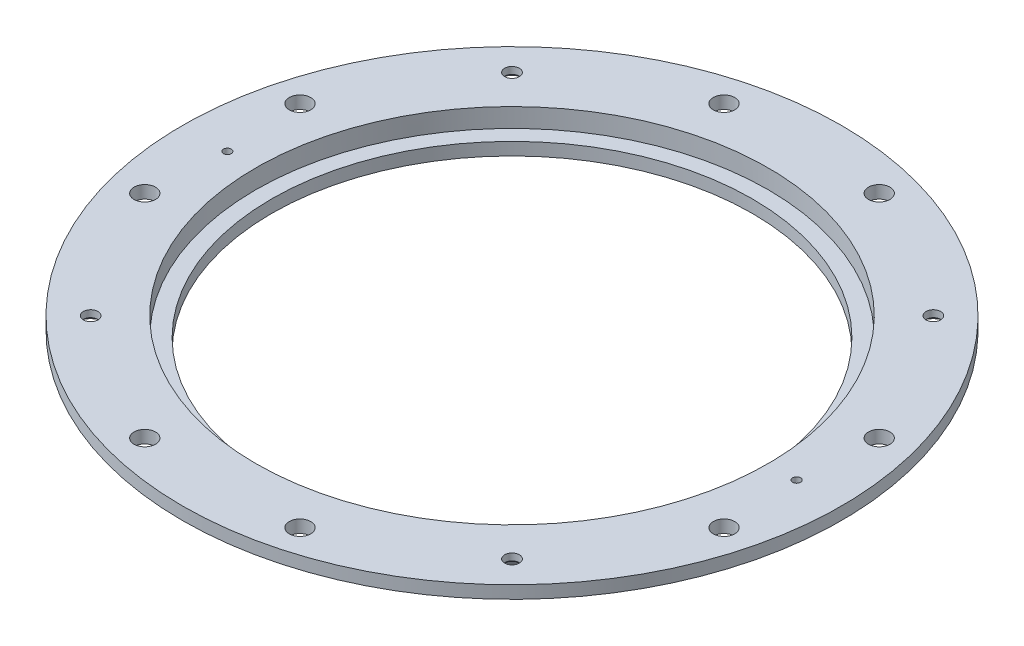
ISO-10303-21;
HEADER;
FILE_DESCRIPTION(('STEP AP214'),'2;1');
FILE_NAME('part.step','',(''),(''),'','','');
FILE_SCHEMA(('AUTOMOTIVE_DESIGN { 1 0 10303 214 1 1 1 1 }'));
ENDSEC;
DATA;
#1=APPLICATION_CONTEXT('core data for automotive mechanical design processes');
#2=APPLICATION_PROTOCOL_DEFINITION('international standard','automotive_design',2000,#1);
#3=PRODUCT_CONTEXT('',#1,'mechanical');
#4=PRODUCT('Part','Part','',(#3));
#5=PRODUCT_RELATED_PRODUCT_CATEGORY('part','',(#4));
#6=PRODUCT_DEFINITION_FORMATION('','',#4);
#7=PRODUCT_DEFINITION_CONTEXT('part definition',#1,'design');
#8=PRODUCT_DEFINITION('design','',#6,#7);
#9=PRODUCT_DEFINITION_SHAPE('','',#8);
#10=(LENGTH_UNIT() NAMED_UNIT(*) SI_UNIT(.MILLI.,.METRE.));
#11=(NAMED_UNIT(*) PLANE_ANGLE_UNIT() SI_UNIT($,.RADIAN.));
#12=(NAMED_UNIT(*) SI_UNIT($,.STERADIAN.) SOLID_ANGLE_UNIT());
#13=UNCERTAINTY_MEASURE_WITH_UNIT(LENGTH_MEASURE(1.E-05),#10,'distance_accuracy_value','');
#14=(GEOMETRIC_REPRESENTATION_CONTEXT(3) GLOBAL_UNCERTAINTY_ASSIGNED_CONTEXT((#13)) GLOBAL_UNIT_ASSIGNED_CONTEXT((#10,
#11,#12)) REPRESENTATION_CONTEXT('',''));
#15=CARTESIAN_POINT('',(0.,0.,0.));
#16=DIRECTION('',(0.,0.,1.));
#17=DIRECTION('',(1.,0.,0.));
#18=AXIS2_PLACEMENT_3D('',#15,#16,#17);
#19=CARTESIAN_POINT('',(0.,2.54,0.));
#20=DIRECTION('',(0.,-1.,0.));
#21=DIRECTION('',(0.,0.,-1.));
#22=AXIS2_PLACEMENT_3D('',#19,#20,#21);
#23=CYLINDRICAL_SURFACE('',#22,66.167);
#24=CARTESIAN_POINT('',(0.,2.54,0.));
#25=DIRECTION('',(0.,1.,0.));
#26=DIRECTION('',(0.,0.,1.));
#27=AXIS2_PLACEMENT_3D('',#24,#25,#26);
#28=CIRCLE('',#27,66.167);
#29=CARTESIAN_POINT('',(0.,2.54,66.167));
#30=VERTEX_POINT('',#29);
#31=EDGE_CURVE('E43',#30,#30,#28,.T.);
#32=ORIENTED_EDGE('',*,*,#31,.F.);
#33=EDGE_LOOP('',(#32));
#34=FACE_BOUND('',#33,.T.);
#35=CARTESIAN_POINT('',(0.,0.,0.));
#36=DIRECTION('',(0.,1.,0.));
#37=DIRECTION('',(0.,0.,1.));
#38=AXIS2_PLACEMENT_3D('',#35,#36,#37);
#39=CIRCLE('',#38,66.167);
#40=CARTESIAN_POINT('',(0.,0.,66.167));
#41=VERTEX_POINT('',#40);
#42=EDGE_CURVE('E48',#41,#41,#39,.T.);
#43=ORIENTED_EDGE('',*,*,#42,.T.);
#44=EDGE_LOOP('',(#43));
#45=FACE_BOUND('',#44,.T.);
#46=ADVANCED_FACE('F36',(#34,#45),#23,.T.);
#47=CARTESIAN_POINT('',(0.,2.54,0.));
#48=DIRECTION('',(0.,1.,0.));
#49=DIRECTION('',(0.,0.,1.));
#50=AXIS2_PLACEMENT_3D('',#47,#48,#49);
#51=PLANE('',#50);
#52=CARTESIAN_POINT('',(0.,2.54,0.));
#53=DIRECTION('',(0.,1.,0.));
#54=DIRECTION('',(0.,0.,1.));
#55=AXIS2_PLACEMENT_3D('',#52,#53,#54);
#56=CIRCLE('',#55,51.435);
#57=CARTESIAN_POINT('',(0.,2.54,51.435));
#58=VERTEX_POINT('',#57);
#59=EDGE_CURVE('E170',#58,#58,#56,.T.);
#60=ORIENTED_EDGE('',*,*,#59,.F.);
#61=EDGE_LOOP('',(#60));
#62=FACE_BOUND('',#61,.T.);
#63=CARTESIAN_POINT('',(-58.1468028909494,2.54,15.5803888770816));
#64=DIRECTION('',(0.,1.,0.));
#65=DIRECTION('',(0.,0.,1.));
#66=AXIS2_PLACEMENT_3D('',#63,#64,#65);
#67=CIRCLE('',#66,2.15265);
#68=CARTESIAN_POINT('',(-58.1468028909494,2.54,17.7330388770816));
#69=VERTEX_POINT('',#68);
#70=EDGE_CURVE('E174',#69,#69,#67,.T.);
#71=ORIENTED_EDGE('',*,*,#70,.F.);
#72=EDGE_LOOP('',(#71));
#73=FACE_BOUND('',#72,.T.);
#74=CARTESIAN_POINT('',(-58.1468028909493,2.54,-15.5803888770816));
#75=DIRECTION('',(0.,1.,0.));
#76=DIRECTION('',(0.,0.,1.));
#77=AXIS2_PLACEMENT_3D('',#74,#75,#76);
#78=CIRCLE('',#77,2.15265);
#79=CARTESIAN_POINT('',(-58.1468028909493,2.54,-13.4277388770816));
#80=VERTEX_POINT('',#79);
#81=EDGE_CURVE('E178',#80,#80,#78,.T.);
#82=ORIENTED_EDGE('',*,*,#81,.F.);
#83=EDGE_LOOP('',(#82));
#84=FACE_BOUND('',#83,.T.);
#85=CARTESIAN_POINT('',(-15.5803953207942,2.54,-58.1468184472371));
#86=DIRECTION('',(0.,1.,0.));
#87=DIRECTION('',(0.,0.,1.));
#88=AXIS2_PLACEMENT_3D('',#85,#86,#87);
#89=CIRCLE('',#88,2.15265);
#90=CARTESIAN_POINT('',(-15.5803953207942,2.54,-55.9941684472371));
#91=VERTEX_POINT('',#90);
#92=EDGE_CURVE('E182',#91,#91,#89,.T.);
#93=ORIENTED_EDGE('',*,*,#92,.F.);
#94=EDGE_LOOP('',(#93));
#95=FACE_BOUND('',#94,.T.);
#96=CARTESIAN_POINT('',(15.5803824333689,2.54,-58.1468184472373));
#97=DIRECTION('',(0.,1.,0.));
#98=DIRECTION('',(0.,0.,1.));
#99=AXIS2_PLACEMENT_3D('',#96,#97,#98);
#100=CIRCLE('',#99,2.15265);
#101=CARTESIAN_POINT('',(15.5803824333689,2.54,-55.9941684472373));
#102=VERTEX_POINT('',#101);
#103=EDGE_CURVE('E72',#102,#102,#100,.T.);
#104=ORIENTED_EDGE('',*,*,#103,.F.);
#105=EDGE_LOOP('',(#104));
#106=FACE_BOUND('',#105,.T.);
#107=CARTESIAN_POINT('',(58.1468028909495,2.54,-15.5803888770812));
#108=DIRECTION('',(0.,1.,0.));
#109=DIRECTION('',(0.,0.,1.));
#110=AXIS2_PLACEMENT_3D('',#107,#108,#109);
#111=CIRCLE('',#110,2.15265);
#112=CARTESIAN_POINT('',(58.1468028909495,2.54,-13.4277388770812));
#113=VERTEX_POINT('',#112);
#114=EDGE_CURVE('E62',#113,#113,#111,.T.);
#115=ORIENTED_EDGE('',*,*,#114,.F.);
#116=EDGE_LOOP('',(#115));
#117=FACE_BOUND('',#116,.T.);
#118=CARTESIAN_POINT('',(58.1468028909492,2.54,15.580388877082));
#119=DIRECTION('',(0.,1.,0.));
#120=DIRECTION('',(0.,0.,1.));
#121=AXIS2_PLACEMENT_3D('',#118,#119,#120);
#122=CIRCLE('',#121,2.15265);
#123=CARTESIAN_POINT('',(58.1468028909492,2.54,17.733038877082));
#124=VERTEX_POINT('',#123);
#125=EDGE_CURVE('E59',#124,#124,#122,.T.);
#126=ORIENTED_EDGE('',*,*,#125,.F.);
#127=EDGE_LOOP('',(#126));
#128=FACE_BOUND('',#127,.T.);
#129=CARTESIAN_POINT('',(15.580388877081,2.54,58.1468028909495));
#130=DIRECTION('',(0.,1.,0.));
#131=DIRECTION('',(0.,0.,1.));
#132=AXIS2_PLACEMENT_3D('',#129,#130,#131);
#133=CIRCLE('',#132,2.15265);
#134=CARTESIAN_POINT('',(15.580388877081,2.54,60.2994528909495));
#135=VERTEX_POINT('',#134);
#136=EDGE_CURVE('E58',#135,#135,#133,.T.);
#137=ORIENTED_EDGE('',*,*,#136,.F.);
#138=EDGE_LOOP('',(#137));
#139=FACE_BOUND('',#138,.T.);
#140=CARTESIAN_POINT('',(-15.5803888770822,2.54,58.1468028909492));
#141=DIRECTION('',(0.,1.,0.));
#142=DIRECTION('',(0.,0.,1.));
#143=AXIS2_PLACEMENT_3D('',#140,#141,#142);
#144=CIRCLE('',#143,2.15265);
#145=CARTESIAN_POINT('',(-15.5803888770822,2.54,60.2994528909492));
#146=VERTEX_POINT('',#145);
#147=EDGE_CURVE('E81',#146,#146,#144,.T.);
#148=ORIENTED_EDGE('',*,*,#147,.F.);
#149=EDGE_LOOP('',(#148));
#150=FACE_BOUND('',#149,.T.);
#151=CARTESIAN_POINT('',(-42.2970063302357,2.54,42.2970063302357));
#152=DIRECTION('',(0.,-1.,0.));
#153=DIRECTION('',(0.,0.,-1.));
#154=AXIS2_PLACEMENT_3D('',#151,#152,#153);
#155=CIRCLE('',#154,1.4732);
#156=CARTESIAN_POINT('',(-42.2970063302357,2.54,40.8238063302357));
#157=VERTEX_POINT('',#156);
#158=EDGE_CURVE('E93',#157,#157,#155,.T.);
#159=ORIENTED_EDGE('',*,*,#158,.T.);
#160=EDGE_LOOP('',(#159));
#161=FACE_BOUND('',#160,.T.);
#162=CARTESIAN_POINT('',(42.2970063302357,2.54,42.2970063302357));
#163=DIRECTION('',(0.,-1.,0.));
#164=DIRECTION('',(0.,0.,-1.));
#165=AXIS2_PLACEMENT_3D('',#162,#163,#164);
#166=CIRCLE('',#165,1.4732);
#167=CARTESIAN_POINT('',(42.2970063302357,2.54,40.8238063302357));
#168=VERTEX_POINT('',#167);
#169=EDGE_CURVE('E102',#168,#168,#166,.T.);
#170=ORIENTED_EDGE('',*,*,#169,.T.);
#171=EDGE_LOOP('',(#170));
#172=FACE_BOUND('',#171,.T.);
#173=CARTESIAN_POINT('',(42.2970063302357,2.54,-42.2970063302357));
#174=DIRECTION('',(0.,-1.,0.));
#175=DIRECTION('',(0.,0.,-1.));
#176=AXIS2_PLACEMENT_3D('',#173,#174,#175);
#177=CIRCLE('',#176,1.4732);
#178=CARTESIAN_POINT('',(42.2970063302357,2.54,-43.7702063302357));
#179=VERTEX_POINT('',#178);
#180=EDGE_CURVE('E111',#179,#179,#177,.T.);
#181=ORIENTED_EDGE('',*,*,#180,.T.);
#182=EDGE_LOOP('',(#181));
#183=FACE_BOUND('',#182,.T.);
#184=CARTESIAN_POINT('',(-42.2970063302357,2.54,-42.2970063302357));
#185=DIRECTION('',(0.,-1.,0.));
#186=DIRECTION('',(0.,0.,-1.));
#187=AXIS2_PLACEMENT_3D('',#184,#185,#186);
#188=CIRCLE('',#187,1.4732);
#189=CARTESIAN_POINT('',(-42.2970063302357,2.54,-43.7702063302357));
#190=VERTEX_POINT('',#189);
#191=EDGE_CURVE('E120',#190,#190,#188,.T.);
#192=ORIENTED_EDGE('',*,*,#191,.T.);
#193=EDGE_LOOP('',(#192));
#194=FACE_BOUND('',#193,.T.);
#195=CARTESIAN_POINT('',(57.15,2.54,0.));
#196=DIRECTION('',(0.,1.,0.));
#197=DIRECTION('',(0.,0.,1.));
#198=AXIS2_PLACEMENT_3D('',#195,#196,#197);
#199=CIRCLE('',#198,0.793749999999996);
#200=CARTESIAN_POINT('',(57.15,2.54,0.793749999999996));
#201=VERTEX_POINT('',#200);
#202=EDGE_CURVE('E123',#201,#201,#199,.T.);
#203=ORIENTED_EDGE('',*,*,#202,.F.);
#204=EDGE_LOOP('',(#203));
#205=FACE_BOUND('',#204,.T.);
#206=CARTESIAN_POINT('',(-57.15,2.54,0.));
#207=DIRECTION('',(0.,1.,0.));
#208=DIRECTION('',(0.,0.,1.));
#209=AXIS2_PLACEMENT_3D('',#206,#207,#208);
#210=CIRCLE('',#209,0.793749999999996);
#211=CARTESIAN_POINT('',(-57.15,2.54,0.793749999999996));
#212=VERTEX_POINT('',#211);
#213=EDGE_CURVE('E129',#212,#212,#210,.T.);
#214=ORIENTED_EDGE('',*,*,#213,.F.);
#215=EDGE_LOOP('',(#214));
#216=FACE_BOUND('',#215,.T.);
#217=ORIENTED_EDGE('',*,*,#31,.T.);
#218=EDGE_LOOP('',(#217));
#219=FACE_BOUND('',#218,.T.);
#220=ADVANCED_FACE('F151',(#62,#73,#84,#95,#106,#117,#128,#139,#150,#161,#172,#183,#194,#205,
#216,#219),#51,.T.);
#221=CARTESIAN_POINT('',(0.,0.,0.));
#222=DIRECTION('',(0.,1.,0.));
#223=DIRECTION('',(0.,0.,1.));
#224=AXIS2_PLACEMENT_3D('',#221,#222,#223);
#225=PLANE('',#224);
#226=CARTESIAN_POINT('',(-58.1468028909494,0.,15.5803888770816));
#227=DIRECTION('',(0.,1.,0.));
#228=DIRECTION('',(0.,0.,1.));
#229=AXIS2_PLACEMENT_3D('',#226,#227,#228);
#230=CIRCLE('',#229,2.15265);
#231=CARTESIAN_POINT('',(-58.1468028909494,0.,17.7330388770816));
#232=VERTEX_POINT('',#231);
#233=EDGE_CURVE('E306',#232,#232,#230,.T.);
#234=ORIENTED_EDGE('',*,*,#233,.T.);
#235=EDGE_LOOP('',(#234));
#236=FACE_BOUND('',#235,.T.);
#237=CARTESIAN_POINT('',(-58.1468028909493,0.,-15.5803888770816));
#238=DIRECTION('',(0.,1.,0.));
#239=DIRECTION('',(0.,0.,1.));
#240=AXIS2_PLACEMENT_3D('',#237,#238,#239);
#241=CIRCLE('',#240,2.15265);
#242=CARTESIAN_POINT('',(-58.1468028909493,0.,-13.4277388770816));
#243=VERTEX_POINT('',#242);
#244=EDGE_CURVE('E310',#243,#243,#241,.T.);
#245=ORIENTED_EDGE('',*,*,#244,.T.);
#246=EDGE_LOOP('',(#245));
#247=FACE_BOUND('',#246,.T.);
#248=CARTESIAN_POINT('',(-15.5803953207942,0.,-58.1468184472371));
#249=DIRECTION('',(0.,1.,0.));
#250=DIRECTION('',(0.,0.,1.));
#251=AXIS2_PLACEMENT_3D('',#248,#249,#250);
#252=CIRCLE('',#251,2.15265);
#253=CARTESIAN_POINT('',(-15.5803953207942,0.,-55.9941684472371));
#254=VERTEX_POINT('',#253);
#255=EDGE_CURVE('E313',#254,#254,#252,.T.);
#256=ORIENTED_EDGE('',*,*,#255,.T.);
#257=EDGE_LOOP('',(#256));
#258=FACE_BOUND('',#257,.T.);
#259=CARTESIAN_POINT('',(15.5803824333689,0.,-58.1468184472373));
#260=DIRECTION('',(0.,1.,0.));
#261=DIRECTION('',(0.,0.,1.));
#262=AXIS2_PLACEMENT_3D('',#259,#260,#261);
#263=CIRCLE('',#262,2.15265);
#264=CARTESIAN_POINT('',(15.5803824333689,0.,-55.9941684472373));
#265=VERTEX_POINT('',#264);
#266=EDGE_CURVE('E39',#265,#265,#263,.T.);
#267=ORIENTED_EDGE('',*,*,#266,.T.);
#268=EDGE_LOOP('',(#267));
#269=FACE_BOUND('',#268,.T.);
#270=CARTESIAN_POINT('',(58.1468028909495,0.,-15.5803888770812));
#271=DIRECTION('',(0.,1.,0.));
#272=DIRECTION('',(0.,0.,1.));
#273=AXIS2_PLACEMENT_3D('',#270,#271,#272);
#274=CIRCLE('',#273,2.15265);
#275=CARTESIAN_POINT('',(58.1468028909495,0.,-13.4277388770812));
#276=VERTEX_POINT('',#275);
#277=EDGE_CURVE('E60',#276,#276,#274,.T.);
#278=ORIENTED_EDGE('',*,*,#277,.T.);
#279=EDGE_LOOP('',(#278));
#280=FACE_BOUND('',#279,.T.);
#281=CARTESIAN_POINT('',(58.1468028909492,0.,15.580388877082));
#282=DIRECTION('',(0.,1.,0.));
#283=DIRECTION('',(0.,0.,1.));
#284=AXIS2_PLACEMENT_3D('',#281,#282,#283);
#285=CIRCLE('',#284,2.15265);
#286=CARTESIAN_POINT('',(58.1468028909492,0.,17.733038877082));
#287=VERTEX_POINT('',#286);
#288=EDGE_CURVE('E56',#287,#287,#285,.T.);
#289=ORIENTED_EDGE('',*,*,#288,.T.);
#290=EDGE_LOOP('',(#289));
#291=FACE_BOUND('',#290,.T.);
#292=CARTESIAN_POINT('',(15.580388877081,0.,58.1468028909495));
#293=DIRECTION('',(0.,1.,0.));
#294=DIRECTION('',(0.,0.,1.));
#295=AXIS2_PLACEMENT_3D('',#292,#293,#294);
#296=CIRCLE('',#295,2.15265);
#297=CARTESIAN_POINT('',(15.580388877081,0.,60.2994528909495));
#298=VERTEX_POINT('',#297);
#299=EDGE_CURVE('E78',#298,#298,#296,.T.);
#300=ORIENTED_EDGE('',*,*,#299,.T.);
#301=EDGE_LOOP('',(#300));
#302=FACE_BOUND('',#301,.T.);
#303=CARTESIAN_POINT('',(-15.5803888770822,0.,58.1468028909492));
#304=DIRECTION('',(0.,1.,0.));
#305=DIRECTION('',(0.,0.,1.));
#306=AXIS2_PLACEMENT_3D('',#303,#304,#305);
#307=CIRCLE('',#306,2.15265);
#308=CARTESIAN_POINT('',(-15.5803888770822,0.,60.2994528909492));
#309=VERTEX_POINT('',#308);
#310=EDGE_CURVE('E84',#309,#309,#307,.T.);
#311=ORIENTED_EDGE('',*,*,#310,.T.);
#312=EDGE_LOOP('',(#311));
#313=FACE_BOUND('',#312,.T.);
#314=CARTESIAN_POINT('',(-42.2970063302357,0.,42.2970063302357));
#315=DIRECTION('',(0.,-1.,0.));
#316=DIRECTION('',(0.,0.,-1.));
#317=AXIS2_PLACEMENT_3D('',#314,#315,#316);
#318=CIRCLE('',#317,2.8575);
#319=CARTESIAN_POINT('',(-42.2970063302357,0.,39.4395063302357));
#320=VERTEX_POINT('',#319);
#321=EDGE_CURVE('E87',#320,#320,#318,.T.);
#322=ORIENTED_EDGE('',*,*,#321,.F.);
#323=EDGE_LOOP('',(#322));
#324=FACE_BOUND('',#323,.T.);
#325=CARTESIAN_POINT('',(42.2970063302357,0.,42.2970063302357));
#326=DIRECTION('',(0.,-1.,0.));
#327=DIRECTION('',(0.,0.,-1.));
#328=AXIS2_PLACEMENT_3D('',#325,#326,#327);
#329=CIRCLE('',#328,2.8575);
#330=CARTESIAN_POINT('',(42.2970063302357,0.,39.4395063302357));
#331=VERTEX_POINT('',#330);
#332=EDGE_CURVE('E96',#331,#331,#329,.T.);
#333=ORIENTED_EDGE('',*,*,#332,.F.);
#334=EDGE_LOOP('',(#333));
#335=FACE_BOUND('',#334,.T.);
#336=CARTESIAN_POINT('',(42.2970063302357,0.,-42.2970063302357));
#337=DIRECTION('',(0.,-1.,0.));
#338=DIRECTION('',(0.,0.,-1.));
#339=AXIS2_PLACEMENT_3D('',#336,#337,#338);
#340=CIRCLE('',#339,2.8575);
#341=CARTESIAN_POINT('',(42.2970063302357,0.,-45.1545063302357));
#342=VERTEX_POINT('',#341);
#343=EDGE_CURVE('E105',#342,#342,#340,.T.);
#344=ORIENTED_EDGE('',*,*,#343,.F.);
#345=EDGE_LOOP('',(#344));
#346=FACE_BOUND('',#345,.T.);
#347=CARTESIAN_POINT('',(-42.2970063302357,0.,-42.2970063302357));
#348=DIRECTION('',(0.,-1.,0.));
#349=DIRECTION('',(0.,0.,-1.));
#350=AXIS2_PLACEMENT_3D('',#347,#348,#349);
#351=CIRCLE('',#350,2.8575);
#352=CARTESIAN_POINT('',(-42.2970063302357,0.,-45.1545063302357));
#353=VERTEX_POINT('',#352);
#354=EDGE_CURVE('E114',#353,#353,#351,.T.);
#355=ORIENTED_EDGE('',*,*,#354,.F.);
#356=EDGE_LOOP('',(#355));
#357=FACE_BOUND('',#356,.T.);
#358=CARTESIAN_POINT('',(57.15,0.,0.));
#359=DIRECTION('',(0.,1.,0.));
#360=DIRECTION('',(0.,0.,1.));
#361=AXIS2_PLACEMENT_3D('',#358,#359,#360);
#362=CIRCLE('',#361,0.793749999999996);
#363=CARTESIAN_POINT('',(57.15,0.,0.793749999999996));
#364=VERTEX_POINT('',#363);
#365=EDGE_CURVE('E126',#364,#364,#362,.T.);
#366=ORIENTED_EDGE('',*,*,#365,.T.);
#367=EDGE_LOOP('',(#366));
#368=FACE_BOUND('',#367,.T.);
#369=CARTESIAN_POINT('',(-57.15,0.,0.));
#370=DIRECTION('',(0.,1.,0.));
#371=DIRECTION('',(0.,0.,1.));
#372=AXIS2_PLACEMENT_3D('',#369,#370,#371);
#373=CIRCLE('',#372,0.793749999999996);
#374=CARTESIAN_POINT('',(-57.15,0.,0.793749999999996));
#375=VERTEX_POINT('',#374);
#376=EDGE_CURVE('E131',#375,#375,#373,.T.);
#377=ORIENTED_EDGE('',*,*,#376,.T.);
#378=EDGE_LOOP('',(#377));
#379=FACE_BOUND('',#378,.T.);
#380=CARTESIAN_POINT('',(0.,0.,0.));
#381=DIRECTION('',(0.,-1.,0.));
#382=DIRECTION('',(0.,0.,-1.));
#383=AXIS2_PLACEMENT_3D('',#380,#381,#382);
#384=CIRCLE('',#383,52.07);
#385=CARTESIAN_POINT('',(0.,0.,52.07));
#386=VERTEX_POINT('',#385);
#387=EDGE_CURVE('E11',#386,#386,#384,.T.);
#388=ORIENTED_EDGE('',*,*,#387,.F.);
#389=EDGE_LOOP('',(#388));
#390=FACE_BOUND('',#389,.T.);
#391=ORIENTED_EDGE('',*,*,#42,.F.);
#392=EDGE_LOOP('',(#391));
#393=FACE_BOUND('',#392,.T.);
#394=ADVANCED_FACE('F142',(#236,#247,#258,#269,#280,#291,#302,#313,#324,#335,#346,#357,#368,
#379,#390,#393),#225,.F.);
#395=CARTESIAN_POINT('',(0.,-3.81,0.));
#396=DIRECTION('',(0.,1.,0.));
#397=DIRECTION('',(0.,0.,1.));
#398=AXIS2_PLACEMENT_3D('',#395,#396,#397);
#399=CYLINDRICAL_SURFACE('',#398,52.07);
#400=CARTESIAN_POINT('',(0.,-3.81,0.));
#401=DIRECTION('',(0.,-1.,0.));
#402=DIRECTION('',(0.,0.,-1.));
#403=AXIS2_PLACEMENT_3D('',#400,#401,#402);
#404=CIRCLE('',#403,52.07);
#405=CARTESIAN_POINT('',(0.,-3.81,52.07));
#406=VERTEX_POINT('',#405);
#407=EDGE_CURVE('E51',#406,#406,#404,.T.);
#408=CARTESIAN_POINT('',(0.,-3.81,52.07));
#409=CARTESIAN_POINT('',(0.,-3.7703125,52.07));
#410=CARTESIAN_POINT('',(0.,-3.730625,52.07));
#411=CARTESIAN_POINT('',(0.,-3.65125,52.07));
#412=CARTESIAN_POINT('',(0.,-3.6115625,52.07));
#413=CARTESIAN_POINT('',(0.,-3.5321875,52.07));
#414=CARTESIAN_POINT('',(0.,-3.4925,52.07));
#415=CARTESIAN_POINT('',(0.,-3.413125,52.07));
#416=CARTESIAN_POINT('',(0.,-3.3734375,52.07));
#417=CARTESIAN_POINT('',(0.,-3.2940625,52.07));
#418=CARTESIAN_POINT('',(0.,-3.254375,52.07));
#419=CARTESIAN_POINT('',(0.,-3.175,52.07));
#420=CARTESIAN_POINT('',(0.,-3.1353125,52.07));
#421=CARTESIAN_POINT('',(0.,-3.0559375,52.07));
#422=CARTESIAN_POINT('',(0.,-3.01625,52.07));
#423=CARTESIAN_POINT('',(0.,-2.936875,52.07));
#424=CARTESIAN_POINT('',(0.,-2.8971875,52.07));
#425=CARTESIAN_POINT('',(0.,-2.8178125,52.07));
#426=CARTESIAN_POINT('',(0.,-2.778125,52.07));
#427=CARTESIAN_POINT('',(0.,-2.69875,52.07));
#428=CARTESIAN_POINT('',(0.,-2.6590625,52.07));
#429=CARTESIAN_POINT('',(0.,-2.5796875,52.07));
#430=CARTESIAN_POINT('',(0.,-2.54,52.07));
#431=CARTESIAN_POINT('',(0.,-2.460625,52.07));
#432=CARTESIAN_POINT('',(0.,-2.4209375,52.07));
#433=CARTESIAN_POINT('',(0.,-2.3415625,52.07));
#434=CARTESIAN_POINT('',(0.,-2.301875,52.07));
#435=CARTESIAN_POINT('',(0.,-2.2225,52.07));
#436=CARTESIAN_POINT('',(0.,-2.1828125,52.07));
#437=CARTESIAN_POINT('',(0.,-2.1034375,52.07));
#438=CARTESIAN_POINT('',(0.,-2.06375,52.07));
#439=CARTESIAN_POINT('',(0.,-1.984375,52.07));
#440=CARTESIAN_POINT('',(0.,-1.9446875,52.07));
#441=CARTESIAN_POINT('',(0.,-1.8653125,52.07));
#442=CARTESIAN_POINT('',(0.,-1.825625,52.07));
#443=CARTESIAN_POINT('',(0.,-1.74625,52.07));
#444=CARTESIAN_POINT('',(0.,-1.7065625,52.07));
#445=CARTESIAN_POINT('',(0.,-1.6271875,52.07));
#446=CARTESIAN_POINT('',(0.,-1.5875,52.07));
#447=CARTESIAN_POINT('',(0.,-1.508125,52.07));
#448=CARTESIAN_POINT('',(0.,-1.4684375,52.07));
#449=CARTESIAN_POINT('',(0.,-1.3890625,52.07));
#450=CARTESIAN_POINT('',(0.,-1.349375,52.07));
#451=CARTESIAN_POINT('',(0.,-1.27,52.07));
#452=CARTESIAN_POINT('',(0.,-1.2303125,52.07));
#453=CARTESIAN_POINT('',(0.,-1.1509375,52.07));
#454=CARTESIAN_POINT('',(0.,-1.11125,52.07));
#455=CARTESIAN_POINT('',(0.,-1.031875,52.07));
#456=CARTESIAN_POINT('',(0.,-0.9921875,52.07));
#457=CARTESIAN_POINT('',(0.,-0.9128125,52.07));
#458=CARTESIAN_POINT('',(0.,-0.873125,52.07));
#459=CARTESIAN_POINT('',(0.,-0.79375,52.07));
#460=CARTESIAN_POINT('',(0.,-0.7540625,52.07));
#461=CARTESIAN_POINT('',(0.,-0.6746875,52.07));
#462=CARTESIAN_POINT('',(0.,-0.635,52.07));
#463=CARTESIAN_POINT('',(0.,-0.555625,52.07));
#464=CARTESIAN_POINT('',(0.,-0.5159375,52.07));
#465=CARTESIAN_POINT('',(0.,-0.4365625,52.07));
#466=CARTESIAN_POINT('',(0.,-0.396875,52.07));
#467=CARTESIAN_POINT('',(0.,-0.3175,52.07));
#468=CARTESIAN_POINT('',(0.,-0.2778125,52.07));
#469=CARTESIAN_POINT('',(0.,-0.1984375,52.07));
#470=CARTESIAN_POINT('',(0.,-0.15875,52.07));
#471=CARTESIAN_POINT('',(0.,-0.0793749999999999,52.07));
#472=CARTESIAN_POINT('',(0.,-0.0396874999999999,52.07));
#473=CARTESIAN_POINT('',(0.,0.,52.07));
#474=B_SPLINE_CURVE_WITH_KNOTS('',3,(#408,#409,#410,#411,#412,#413,#414,#415,#416,#417,#418,
#419,#420,#421,#422,#423,#424,#425,#426,#427,#428,#429,#430,#431,#432,#433,#434,#435,#436,#437,
#438,#439,#440,#441,#442,#443,#444,#445,#446,#447,#448,#449,#450,#451,#452,#453,#454,#455,#456,
#457,#458,#459,#460,#461,#462,#463,#464,#465,#466,#467,#468,#469,#470,#471,#472,#473),
.UNSPECIFIED.,.F.,.F.,(4,2,2,2,2,2,2,2,2,2,2,2,2,2,2,2,2,2,2,2,2,2,2,2,2,2,2,2,2,2,2,2,4),(0.,
0.1190625,0.238125,0.3571875,0.47625,0.595312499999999,0.714375,0.833437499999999,
0.952499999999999,1.0715625,1.190625,1.3096875,1.42875,1.5478125,1.666875,1.7859375,1.905,
2.0240625,2.143125,2.2621875,2.38125,2.5003125,2.619375,2.7384375,2.8575,2.9765625,3.095625,
3.2146875,3.33375,3.4528125,3.571875,3.6909375,3.81),.UNSPECIFIED.);
#475=EDGE_CURVE('BSEAM140',#406,#386,#474,.T.);
#476=ORIENTED_EDGE('',*,*,#407,.F.);
#477=ORIENTED_EDGE('',*,*,#387,.T.);
#478=ORIENTED_EDGE('',*,*,#475,.T.);
#479=ORIENTED_EDGE('',*,*,#475,.F.);
#480=EDGE_LOOP('',(#476,#478,#477,#479));
#481=FACE_BOUND('',#480,.T.);
#482=ADVANCED_FACE('F140',(#481),#399,.T.);
#483=CARTESIAN_POINT('',(0.,-3.81,0.));
#484=DIRECTION('',(0.,-1.,0.));
#485=DIRECTION('',(0.,0.,-1.));
#486=AXIS2_PLACEMENT_3D('',#483,#484,#485);
#487=PLANE('',#486);
#488=CARTESIAN_POINT('',(0.,-3.81,0.));
#489=DIRECTION('',(0.,1.,0.));
#490=DIRECTION('',(0.,0.,1.));
#491=AXIS2_PLACEMENT_3D('',#488,#489,#490);
#492=CIRCLE('',#491,48.26);
#493=CARTESIAN_POINT('',(0.,-3.81,48.26));
#494=VERTEX_POINT('',#493);
#495=EDGE_CURVE('E294',#494,#494,#492,.T.);
#496=ORIENTED_EDGE('',*,*,#495,.T.);
#497=EDGE_LOOP('',(#496));
#498=FACE_BOUND('',#497,.T.);
#499=ORIENTED_EDGE('',*,*,#407,.T.);
#500=EDGE_LOOP('',(#499));
#501=FACE_BOUND('',#500,.T.);
#502=ADVANCED_FACE('F138',(#498,#501),#487,.T.);
#503=CARTESIAN_POINT('',(0.,-1.27,0.));
#504=DIRECTION('',(0.,-1.,0.));
#505=DIRECTION('',(0.,0.,-1.));
#506=AXIS2_PLACEMENT_3D('',#503,#504,#505);
#507=PLANE('',#506);
#508=CARTESIAN_POINT('',(0.,-1.27,0.));
#509=DIRECTION('',(0.,1.,0.));
#510=DIRECTION('',(0.,0.,1.));
#511=AXIS2_PLACEMENT_3D('',#508,#509,#510);
#512=CIRCLE('',#511,48.26);
#513=CARTESIAN_POINT('',(0.,-1.27,48.26));
#514=VERTEX_POINT('',#513);
#515=EDGE_CURVE('E297',#514,#514,#512,.T.);
#516=ORIENTED_EDGE('',*,*,#515,.F.);
#517=EDGE_LOOP('',(#516));
#518=FACE_BOUND('',#517,.T.);
#519=CARTESIAN_POINT('',(0.,-1.26999999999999,0.));
#520=DIRECTION('',(0.,-1.,0.));
#521=DIRECTION('',(0.,0.,-1.));
#522=AXIS2_PLACEMENT_3D('',#519,#520,#521);
#523=CIRCLE('',#522,51.435);
#524=CARTESIAN_POINT('',(0.,-1.26999999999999,-51.435));
#525=VERTEX_POINT('',#524);
#526=EDGE_CURVE('E302',#525,#525,#523,.F.);
#527=ORIENTED_EDGE('',*,*,#526,.T.);
#528=EDGE_LOOP('',(#527));
#529=FACE_BOUND('',#528,.T.);
#530=ADVANCED_FACE('F148',(#518,#529),#507,.F.);
#531=CARTESIAN_POINT('',(-57.15,2.54,0.));
#532=DIRECTION('',(0.,1.,0.));
#533=DIRECTION('',(0.,0.,1.));
#534=AXIS2_PLACEMENT_3D('',#531,#532,#533);
#535=CYLINDRICAL_SURFACE('',#534,0.793749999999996);
#536=ORIENTED_EDGE('',*,*,#213,.T.);
#537=EDGE_LOOP('',(#536));
#538=FACE_BOUND('',#537,.T.);
#539=ORIENTED_EDGE('',*,*,#376,.F.);
#540=EDGE_LOOP('',(#539));
#541=FACE_BOUND('',#540,.T.);
#542=ADVANCED_FACE('F205',(#538,#541),#535,.F.);
#543=CARTESIAN_POINT('',(57.15,2.54,0.));
#544=DIRECTION('',(0.,1.,0.));
#545=DIRECTION('',(0.,0.,1.));
#546=AXIS2_PLACEMENT_3D('',#543,#544,#545);
#547=CYLINDRICAL_SURFACE('',#546,0.793749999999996);
#548=ORIENTED_EDGE('',*,*,#202,.T.);
#549=EDGE_LOOP('',(#548));
#550=FACE_BOUND('',#549,.T.);
#551=ORIENTED_EDGE('',*,*,#365,.F.);
#552=EDGE_LOOP('',(#551));
#553=FACE_BOUND('',#552,.T.);
#554=ADVANCED_FACE('F208',(#550,#553),#547,.F.);
#555=CARTESIAN_POINT('',(-42.2970063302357,0.,-42.2970063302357));
#556=DIRECTION('',(0.,-1.,0.));
#557=DIRECTION('',(0.,0.,-1.));
#558=AXIS2_PLACEMENT_3D('',#555,#556,#557);
#559=CYLINDRICAL_SURFACE('',#558,1.4732);
#560=ORIENTED_EDGE('',*,*,#191,.F.);
#561=EDGE_LOOP('',(#560));
#562=FACE_BOUND('',#561,.T.);
#563=CARTESIAN_POINT('',(-42.2970063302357,1.16156561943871,-42.2970063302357));
#564=DIRECTION('',(0.,-1.,0.));
#565=DIRECTION('',(0.,0.,-1.));
#566=AXIS2_PLACEMENT_3D('',#563,#564,#565);
#567=CIRCLE('',#566,1.4732);
#568=CARTESIAN_POINT('',(-42.2970063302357,1.16156561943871,-43.7702063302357));
#569=VERTEX_POINT('',#568);
#570=EDGE_CURVE('E117',#569,#569,#567,.T.);
#571=ORIENTED_EDGE('',*,*,#570,.T.);
#572=EDGE_LOOP('',(#571));
#573=FACE_BOUND('',#572,.T.);
#574=ADVANCED_FACE('F214',(#562,#573),#559,.F.);
#575=CARTESIAN_POINT('',(-42.2970063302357,0.,-42.2970063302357));
#576=DIRECTION('',(0.,-1.,0.));
#577=DIRECTION('',(0.,0.,-1.));
#578=AXIS2_PLACEMENT_3D('',#575,#576,#577);
#579=CONICAL_SURFACE('',#578,2.8575,0.872664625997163);
#580=ORIENTED_EDGE('',*,*,#570,.F.);
#581=EDGE_LOOP('',(#580));
#582=FACE_BOUND('',#581,.T.);
#583=ORIENTED_EDGE('',*,*,#354,.T.);
#584=EDGE_LOOP('',(#583));
#585=FACE_BOUND('',#584,.T.);
#586=ADVANCED_FACE('F222',(#582,#585),#579,.F.);
#587=CARTESIAN_POINT('',(42.2970063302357,0.,-42.2970063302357));
#588=DIRECTION('',(0.,-1.,0.));
#589=DIRECTION('',(0.,0.,-1.));
#590=AXIS2_PLACEMENT_3D('',#587,#588,#589);
#591=CYLINDRICAL_SURFACE('',#590,1.4732);
#592=ORIENTED_EDGE('',*,*,#180,.F.);
#593=EDGE_LOOP('',(#592));
#594=FACE_BOUND('',#593,.T.);
#595=CARTESIAN_POINT('',(42.2970063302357,1.16156561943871,-42.2970063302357));
#596=DIRECTION('',(0.,-1.,0.));
#597=DIRECTION('',(0.,0.,-1.));
#598=AXIS2_PLACEMENT_3D('',#595,#596,#597);
#599=CIRCLE('',#598,1.4732);
#600=CARTESIAN_POINT('',(42.2970063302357,1.16156561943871,-43.7702063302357));
#601=VERTEX_POINT('',#600);
#602=EDGE_CURVE('E108',#601,#601,#599,.T.);
#603=ORIENTED_EDGE('',*,*,#602,.T.);
#604=EDGE_LOOP('',(#603));
#605=FACE_BOUND('',#604,.T.);
#606=ADVANCED_FACE('F226',(#594,#605),#591,.F.);
#607=CARTESIAN_POINT('',(42.2970063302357,0.,-42.2970063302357));
#608=DIRECTION('',(0.,-1.,0.));
#609=DIRECTION('',(0.,0.,-1.));
#610=AXIS2_PLACEMENT_3D('',#607,#608,#609);
#611=CONICAL_SURFACE('',#610,2.8575,0.872664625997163);
#612=ORIENTED_EDGE('',*,*,#602,.F.);
#613=EDGE_LOOP('',(#612));
#614=FACE_BOUND('',#613,.T.);
#615=ORIENTED_EDGE('',*,*,#343,.T.);
#616=EDGE_LOOP('',(#615));
#617=FACE_BOUND('',#616,.T.);
#618=ADVANCED_FACE('F230',(#614,#617),#611,.F.);
#619=CARTESIAN_POINT('',(42.2970063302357,0.,42.2970063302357));
#620=DIRECTION('',(0.,-1.,0.));
#621=DIRECTION('',(0.,0.,-1.));
#622=AXIS2_PLACEMENT_3D('',#619,#620,#621);
#623=CYLINDRICAL_SURFACE('',#622,1.4732);
#624=ORIENTED_EDGE('',*,*,#169,.F.);
#625=EDGE_LOOP('',(#624));
#626=FACE_BOUND('',#625,.T.);
#627=CARTESIAN_POINT('',(42.2970063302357,1.16156561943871,42.2970063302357));
#628=DIRECTION('',(0.,-1.,0.));
#629=DIRECTION('',(0.,0.,-1.));
#630=AXIS2_PLACEMENT_3D('',#627,#628,#629);
#631=CIRCLE('',#630,1.4732);
#632=CARTESIAN_POINT('',(42.2970063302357,1.16156561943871,40.8238063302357));
#633=VERTEX_POINT('',#632);
#634=EDGE_CURVE('E99',#633,#633,#631,.T.);
#635=ORIENTED_EDGE('',*,*,#634,.T.);
#636=EDGE_LOOP('',(#635));
#637=FACE_BOUND('',#636,.T.);
#638=ADVANCED_FACE('F234',(#626,#637),#623,.F.);
#639=CARTESIAN_POINT('',(42.2970063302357,0.,42.2970063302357));
#640=DIRECTION('',(0.,-1.,0.));
#641=DIRECTION('',(0.,0.,-1.));
#642=AXIS2_PLACEMENT_3D('',#639,#640,#641);
#643=CONICAL_SURFACE('',#642,2.8575,0.872664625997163);
#644=ORIENTED_EDGE('',*,*,#634,.F.);
#645=EDGE_LOOP('',(#644));
#646=FACE_BOUND('',#645,.T.);
#647=ORIENTED_EDGE('',*,*,#332,.T.);
#648=EDGE_LOOP('',(#647));
#649=FACE_BOUND('',#648,.T.);
#650=ADVANCED_FACE('F238',(#646,#649),#643,.F.);
#651=CARTESIAN_POINT('',(-42.2970063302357,0.,42.2970063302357));
#652=DIRECTION('',(0.,-1.,0.));
#653=DIRECTION('',(0.,0.,-1.));
#654=AXIS2_PLACEMENT_3D('',#651,#652,#653);
#655=CYLINDRICAL_SURFACE('',#654,1.4732);
#656=ORIENTED_EDGE('',*,*,#158,.F.);
#657=EDGE_LOOP('',(#656));
#658=FACE_BOUND('',#657,.T.);
#659=CARTESIAN_POINT('',(-42.2970063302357,1.16156561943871,42.2970063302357));
#660=DIRECTION('',(0.,-1.,0.));
#661=DIRECTION('',(0.,0.,-1.));
#662=AXIS2_PLACEMENT_3D('',#659,#660,#661);
#663=CIRCLE('',#662,1.4732);
#664=CARTESIAN_POINT('',(-42.2970063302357,1.16156561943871,40.8238063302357));
#665=VERTEX_POINT('',#664);
#666=EDGE_CURVE('E90',#665,#665,#663,.T.);
#667=ORIENTED_EDGE('',*,*,#666,.T.);
#668=EDGE_LOOP('',(#667));
#669=FACE_BOUND('',#668,.T.);
#670=ADVANCED_FACE('F242',(#658,#669),#655,.F.);
#671=CARTESIAN_POINT('',(-42.2970063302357,0.,42.2970063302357));
#672=DIRECTION('',(0.,-1.,0.));
#673=DIRECTION('',(0.,0.,-1.));
#674=AXIS2_PLACEMENT_3D('',#671,#672,#673);
#675=CONICAL_SURFACE('',#674,2.8575,0.872664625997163);
#676=ORIENTED_EDGE('',*,*,#666,.F.);
#677=EDGE_LOOP('',(#676));
#678=FACE_BOUND('',#677,.T.);
#679=ORIENTED_EDGE('',*,*,#321,.T.);
#680=EDGE_LOOP('',(#679));
#681=FACE_BOUND('',#680,.T.);
#682=ADVANCED_FACE('F246',(#678,#681),#675,.F.);
#683=CARTESIAN_POINT('',(-15.5803888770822,2.54,58.1468028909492));
#684=DIRECTION('',(0.,1.,0.));
#685=DIRECTION('',(0.,0.,1.));
#686=AXIS2_PLACEMENT_3D('',#683,#684,#685);
#687=CYLINDRICAL_SURFACE('',#686,2.15265);
#688=ORIENTED_EDGE('',*,*,#147,.T.);
#689=EDGE_LOOP('',(#688));
#690=FACE_BOUND('',#689,.T.);
#691=ORIENTED_EDGE('',*,*,#310,.F.);
#692=EDGE_LOOP('',(#691));
#693=FACE_BOUND('',#692,.T.);
#694=ADVANCED_FACE('F250',(#690,#693),#687,.F.);
#695=CARTESIAN_POINT('',(15.580388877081,2.54,58.1468028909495));
#696=DIRECTION('',(0.,1.,0.));
#697=DIRECTION('',(0.,0.,1.));
#698=AXIS2_PLACEMENT_3D('',#695,#696,#697);
#699=CYLINDRICAL_SURFACE('',#698,2.15265);
#700=ORIENTED_EDGE('',*,*,#136,.T.);
#701=EDGE_LOOP('',(#700));
#702=FACE_BOUND('',#701,.T.);
#703=ORIENTED_EDGE('',*,*,#299,.F.);
#704=EDGE_LOOP('',(#703));
#705=FACE_BOUND('',#704,.T.);
#706=ADVANCED_FACE('F254',(#702,#705),#699,.F.);
#707=CARTESIAN_POINT('',(58.1468028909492,2.54,15.580388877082));
#708=DIRECTION('',(0.,1.,0.));
#709=DIRECTION('',(0.,0.,1.));
#710=AXIS2_PLACEMENT_3D('',#707,#708,#709);
#711=CYLINDRICAL_SURFACE('',#710,2.15265);
#712=ORIENTED_EDGE('',*,*,#125,.T.);
#713=EDGE_LOOP('',(#712));
#714=FACE_BOUND('',#713,.T.);
#715=ORIENTED_EDGE('',*,*,#288,.F.);
#716=EDGE_LOOP('',(#715));
#717=FACE_BOUND('',#716,.T.);
#718=ADVANCED_FACE('F258',(#714,#717),#711,.F.);
#719=CARTESIAN_POINT('',(58.1468028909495,2.54,-15.5803888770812));
#720=DIRECTION('',(0.,1.,0.));
#721=DIRECTION('',(0.,0.,1.));
#722=AXIS2_PLACEMENT_3D('',#719,#720,#721);
#723=CYLINDRICAL_SURFACE('',#722,2.15265);
#724=ORIENTED_EDGE('',*,*,#114,.T.);
#725=EDGE_LOOP('',(#724));
#726=FACE_BOUND('',#725,.T.);
#727=ORIENTED_EDGE('',*,*,#277,.F.);
#728=EDGE_LOOP('',(#727));
#729=FACE_BOUND('',#728,.T.);
#730=ADVANCED_FACE('F262',(#726,#729),#723,.F.);
#731=CARTESIAN_POINT('',(15.5803824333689,2.54,-58.1468184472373));
#732=DIRECTION('',(0.,1.,0.));
#733=DIRECTION('',(0.,0.,1.));
#734=AXIS2_PLACEMENT_3D('',#731,#732,#733);
#735=CYLINDRICAL_SURFACE('',#734,2.15265);
#736=ORIENTED_EDGE('',*,*,#103,.T.);
#737=EDGE_LOOP('',(#736));
#738=FACE_BOUND('',#737,.T.);
#739=ORIENTED_EDGE('',*,*,#266,.F.);
#740=EDGE_LOOP('',(#739));
#741=FACE_BOUND('',#740,.T.);
#742=ADVANCED_FACE('F266',(#738,#741),#735,.F.);
#743=CARTESIAN_POINT('',(-15.5803953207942,2.54,-58.1468184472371));
#744=DIRECTION('',(0.,1.,0.));
#745=DIRECTION('',(0.,0.,1.));
#746=AXIS2_PLACEMENT_3D('',#743,#744,#745);
#747=CYLINDRICAL_SURFACE('',#746,2.15265);
#748=ORIENTED_EDGE('',*,*,#92,.T.);
#749=EDGE_LOOP('',(#748));
#750=FACE_BOUND('',#749,.T.);
#751=ORIENTED_EDGE('',*,*,#255,.F.);
#752=EDGE_LOOP('',(#751));
#753=FACE_BOUND('',#752,.T.);
#754=ADVANCED_FACE('F269',(#750,#753),#747,.F.);
#755=CARTESIAN_POINT('',(-58.1468028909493,2.54,-15.5803888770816));
#756=DIRECTION('',(0.,1.,0.));
#757=DIRECTION('',(0.,0.,1.));
#758=AXIS2_PLACEMENT_3D('',#755,#756,#757);
#759=CYLINDRICAL_SURFACE('',#758,2.15265);
#760=ORIENTED_EDGE('',*,*,#81,.T.);
#761=EDGE_LOOP('',(#760));
#762=FACE_BOUND('',#761,.T.);
#763=ORIENTED_EDGE('',*,*,#244,.F.);
#764=EDGE_LOOP('',(#763));
#765=FACE_BOUND('',#764,.T.);
#766=ADVANCED_FACE('F273',(#762,#765),#759,.F.);
#767=CARTESIAN_POINT('',(-58.1468028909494,2.54,15.5803888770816));
#768=DIRECTION('',(0.,1.,0.));
#769=DIRECTION('',(0.,0.,1.));
#770=AXIS2_PLACEMENT_3D('',#767,#768,#769);
#771=CYLINDRICAL_SURFACE('',#770,2.15265);
#772=ORIENTED_EDGE('',*,*,#70,.T.);
#773=EDGE_LOOP('',(#772));
#774=FACE_BOUND('',#773,.T.);
#775=ORIENTED_EDGE('',*,*,#233,.F.);
#776=EDGE_LOOP('',(#775));
#777=FACE_BOUND('',#776,.T.);
#778=ADVANCED_FACE('F277',(#774,#777),#771,.F.);
#779=CARTESIAN_POINT('',(0.,-146.75014916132,0.));
#780=DIRECTION('',(0.,1.,0.));
#781=DIRECTION('',(0.,0.,1.));
#782=AXIS2_PLACEMENT_3D('',#779,#780,#781);
#783=CYLINDRICAL_SURFACE('',#782,51.435);
#784=ORIENTED_EDGE('',*,*,#59,.T.);
#785=EDGE_LOOP('',(#784));
#786=FACE_BOUND('',#785,.T.);
#787=ORIENTED_EDGE('',*,*,#526,.F.);
#788=EDGE_LOOP('',(#787));
#789=FACE_BOUND('',#788,.T.);
#790=ADVANCED_FACE('F281',(#786,#789),#783,.F.);
#791=CARTESIAN_POINT('',(0.,-3.81,0.));
#792=DIRECTION('',(0.,1.,0.));
#793=DIRECTION('',(0.,0.,1.));
#794=AXIS2_PLACEMENT_3D('',#791,#792,#793);
#795=CYLINDRICAL_SURFACE('',#794,48.26);
#796=ORIENTED_EDGE('',*,*,#495,.F.);
#797=EDGE_LOOP('',(#796));
#798=FACE_BOUND('',#797,.T.);
#799=ORIENTED_EDGE('',*,*,#515,.T.);
#800=EDGE_LOOP('',(#799));
#801=FACE_BOUND('',#800,.T.);
#802=ADVANCED_FACE('F285',(#798,#801),#795,.F.);
#803=CLOSED_SHELL('',(#46,#220,#394,#482,#502,#530,#542,#554,#574,#586,#606,#618,#638,#650,#670,
#682,#694,#706,#718,#730,#742,#754,#766,#778,#790,#802));
#804=MANIFOLD_SOLID_BREP('B2',#803);
#805=ADVANCED_BREP_SHAPE_REPRESENTATION('',(#18,#804),#14);
#806=SHAPE_DEFINITION_REPRESENTATION(#9,#805);
ENDSEC;
END-ISO-10303-21;
